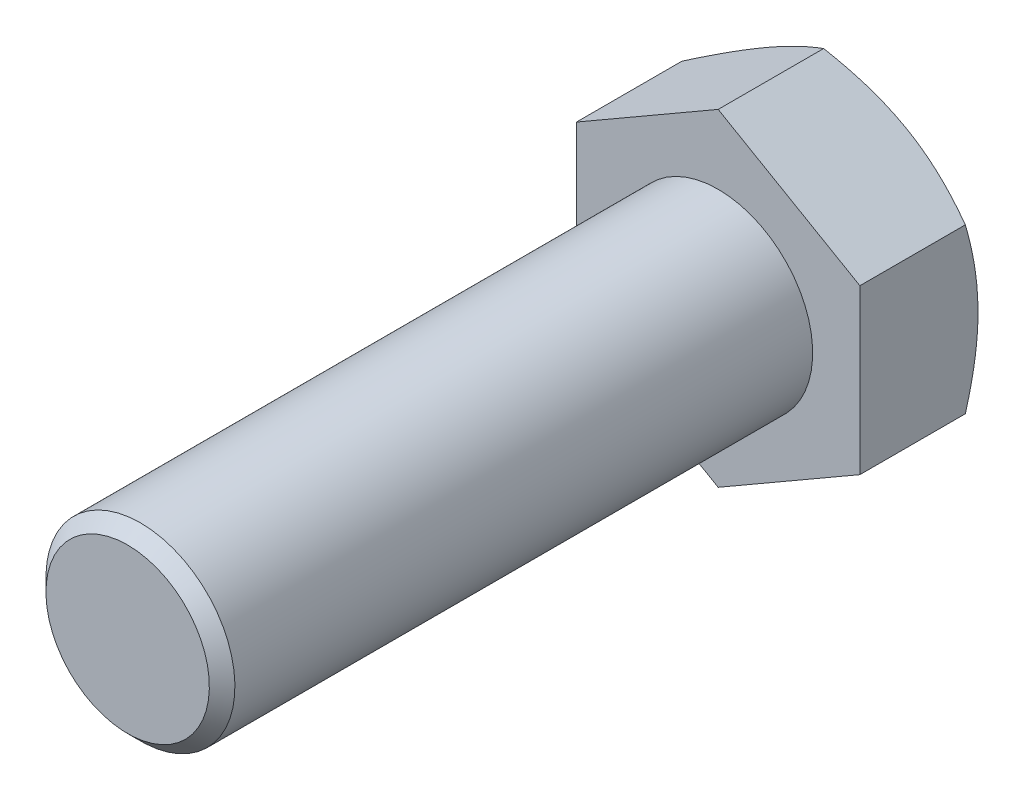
ISO-10303-21;
HEADER;
FILE_DESCRIPTION(('STEP AP214'),'2;1');
FILE_NAME('part.step','',(''),(''),'','','');
FILE_SCHEMA(('AUTOMOTIVE_DESIGN { 1 0 10303 214 1 1 1 1 }'));
ENDSEC;
DATA;
#1=APPLICATION_CONTEXT('core data for automotive mechanical design processes');
#2=APPLICATION_PROTOCOL_DEFINITION('international standard','automotive_design',2000,#1);
#3=PRODUCT_CONTEXT('',#1,'mechanical');
#4=PRODUCT('Part','Part','',(#3));
#5=PRODUCT_RELATED_PRODUCT_CATEGORY('part','',(#4));
#6=PRODUCT_DEFINITION_FORMATION('','',#4);
#7=PRODUCT_DEFINITION_CONTEXT('part definition',#1,'design');
#8=PRODUCT_DEFINITION('design','',#6,#7);
#9=PRODUCT_DEFINITION_SHAPE('','',#8);
#10=(LENGTH_UNIT() NAMED_UNIT(*) SI_UNIT(.MILLI.,.METRE.));
#11=(NAMED_UNIT(*) PLANE_ANGLE_UNIT() SI_UNIT($,.RADIAN.));
#12=(NAMED_UNIT(*) SI_UNIT($,.STERADIAN.) SOLID_ANGLE_UNIT());
#13=UNCERTAINTY_MEASURE_WITH_UNIT(LENGTH_MEASURE(1.E-05),#10,'distance_accuracy_value','');
#14=(GEOMETRIC_REPRESENTATION_CONTEXT(3) GLOBAL_UNCERTAINTY_ASSIGNED_CONTEXT((#13)) GLOBAL_UNIT_ASSIGNED_CONTEXT((#10,
#11,#12)) REPRESENTATION_CONTEXT('',''));
#15=CARTESIAN_POINT('',(0.,0.,0.));
#16=DIRECTION('',(0.,0.,1.));
#17=DIRECTION('',(1.,0.,0.));
#18=AXIS2_PLACEMENT_3D('',#15,#16,#17);
#19=CARTESIAN_POINT('',(0.,0.,0.));
#20=DIRECTION('',(0.,0.,-1.));
#21=DIRECTION('',(-1.,0.,0.));
#22=AXIS2_PLACEMENT_3D('',#19,#20,#21);
#23=PLANE('',#22);
#24=DIRECTION('',(0.866025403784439,-0.5,0.));
#25=VECTOR('',#24,1.);
#26=CARTESIAN_POINT('',(0.,13.856406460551,0.));
#27=LINE('',#26,#25);
#28=CARTESIAN_POINT('',(0.,13.856406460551,0.));
#29=VERTEX_POINT('',#28);
#30=CARTESIAN_POINT('',(12.,6.92820323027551,0.));
#31=VERTEX_POINT('',#30);
#32=EDGE_CURVE('E11',#29,#31,#27,.T.);
#33=ORIENTED_EDGE('',*,*,#32,.F.);
#34=DIRECTION('',(0.866025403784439,0.5,0.));
#35=VECTOR('',#34,1.);
#36=CARTESIAN_POINT('',(-12.,6.92820323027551,0.));
#37=LINE('',#36,#35);
#38=CARTESIAN_POINT('',(-12.,6.92820323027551,0.));
#39=VERTEX_POINT('',#38);
#40=EDGE_CURVE('E133',#39,#29,#37,.T.);
#41=ORIENTED_EDGE('',*,*,#40,.F.);
#42=DIRECTION('',(0.,1.,0.));
#43=VECTOR('',#42,1.);
#44=CARTESIAN_POINT('',(-12.,-6.92820323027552,0.));
#45=LINE('',#44,#43);
#46=CARTESIAN_POINT('',(-12.,-6.92820323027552,0.));
#47=VERTEX_POINT('',#46);
#48=EDGE_CURVE('E28',#47,#39,#45,.T.);
#49=ORIENTED_EDGE('',*,*,#48,.F.);
#50=DIRECTION('',(-0.866025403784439,0.5,0.));
#51=VECTOR('',#50,1.);
#52=CARTESIAN_POINT('',(0.,-13.856406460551,0.));
#53=LINE('',#52,#51);
#54=CARTESIAN_POINT('',(0.,-13.856406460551,0.));
#55=VERTEX_POINT('',#54);
#56=EDGE_CURVE('E104',#55,#47,#53,.T.);
#57=ORIENTED_EDGE('',*,*,#56,.F.);
#58=DIRECTION('',(-0.866025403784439,-0.5,0.));
#59=VECTOR('',#58,1.);
#60=CARTESIAN_POINT('',(12.,-6.92820323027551,0.));
#61=LINE('',#60,#59);
#62=CARTESIAN_POINT('',(12.,-6.92820323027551,0.));
#63=VERTEX_POINT('',#62);
#64=EDGE_CURVE('E99',#63,#55,#61,.T.);
#65=ORIENTED_EDGE('',*,*,#64,.F.);
#66=DIRECTION('',(0.,-1.,0.));
#67=VECTOR('',#66,1.);
#68=CARTESIAN_POINT('',(12.,6.92820323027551,0.));
#69=LINE('',#68,#67);
#70=EDGE_CURVE('E154',#31,#63,#69,.T.);
#71=ORIENTED_EDGE('',*,*,#70,.F.);
#72=EDGE_LOOP('',(#33,#41,#49,#57,#65,#71));
#73=FACE_BOUND('',#72,.T.);
#74=CARTESIAN_POINT('',(0.,0.,0.));
#75=DIRECTION('',(0.,0.,-1.));
#76=DIRECTION('',(0.,1.,0.));
#77=AXIS2_PLACEMENT_3D('',#74,#75,#76);
#78=CIRCLE('',#77,8.);
#79=CARTESIAN_POINT('',(0.,-8.,0.));
#80=VERTEX_POINT('',#79);
#81=EDGE_CURVE('E175',#80,#80,#78,.T.);
#82=ORIENTED_EDGE('',*,*,#81,.T.);
#83=EDGE_LOOP('',(#82));
#84=FACE_BOUND('',#83,.T.);
#85=ADVANCED_FACE('F16',(#73,#84),#23,.F.);
#86=CARTESIAN_POINT('',(0.,0.,-10.));
#87=DIRECTION('',(0.,0.,-1.));
#88=DIRECTION('',(-1.,0.,0.));
#89=AXIS2_PLACEMENT_3D('',#86,#87,#88);
#90=PLANE('',#89);
#91=CARTESIAN_POINT('',(0.,0.,-10.));
#92=DIRECTION('',(0.,0.,1.));
#93=DIRECTION('',(0.,1.,0.));
#94=AXIS2_PLACEMENT_3D('',#91,#92,#93);
#95=CIRCLE('',#94,12.);
#96=CARTESIAN_POINT('',(6.,-10.3923048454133,-10.));
#97=VERTEX_POINT('',#96);
#98=CARTESIAN_POINT('',(12.,0.,-10.));
#99=VERTEX_POINT('',#98);
#100=EDGE_CURVE('E124',#97,#99,#95,.T.);
#101=ORIENTED_EDGE('',*,*,#100,.F.);
#102=CARTESIAN_POINT('',(0.,0.,-10.));
#103=DIRECTION('',(0.,0.,1.));
#104=DIRECTION('',(0.,1.,0.));
#105=AXIS2_PLACEMENT_3D('',#102,#103,#104);
#106=CIRCLE('',#105,12.);
#107=CARTESIAN_POINT('',(-6.,-10.3923048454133,-10.));
#108=VERTEX_POINT('',#107);
#109=EDGE_CURVE('E112',#108,#97,#106,.T.);
#110=ORIENTED_EDGE('',*,*,#109,.F.);
#111=CARTESIAN_POINT('',(0.,0.,-10.));
#112=DIRECTION('',(0.,0.,1.));
#113=DIRECTION('',(0.,1.,0.));
#114=AXIS2_PLACEMENT_3D('',#111,#112,#113);
#115=CIRCLE('',#114,12.);
#116=CARTESIAN_POINT('',(-12.,0.,-10.));
#117=VERTEX_POINT('',#116);
#118=EDGE_CURVE('E165',#117,#108,#115,.T.);
#119=ORIENTED_EDGE('',*,*,#118,.F.);
#120=CARTESIAN_POINT('',(0.,0.,-10.));
#121=DIRECTION('',(0.,0.,1.));
#122=DIRECTION('',(0.,1.,0.));
#123=AXIS2_PLACEMENT_3D('',#120,#121,#122);
#124=CIRCLE('',#123,12.);
#125=CARTESIAN_POINT('',(-6.,10.3923048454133,-10.));
#126=VERTEX_POINT('',#125);
#127=EDGE_CURVE('E149',#126,#117,#124,.T.);
#128=ORIENTED_EDGE('',*,*,#127,.F.);
#129=CARTESIAN_POINT('',(0.,0.,-10.));
#130=DIRECTION('',(0.,0.,1.));
#131=DIRECTION('',(0.,1.,0.));
#132=AXIS2_PLACEMENT_3D('',#129,#130,#131);
#133=CIRCLE('',#132,12.);
#134=CARTESIAN_POINT('',(6.,10.3923048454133,-10.));
#135=VERTEX_POINT('',#134);
#136=EDGE_CURVE('E211',#135,#126,#133,.T.);
#137=ORIENTED_EDGE('',*,*,#136,.F.);
#138=CARTESIAN_POINT('',(0.,0.,-10.));
#139=DIRECTION('',(0.,0.,1.));
#140=DIRECTION('',(0.,1.,0.));
#141=AXIS2_PLACEMENT_3D('',#138,#139,#140);
#142=CIRCLE('',#141,12.);
#143=EDGE_CURVE('E105',#99,#135,#142,.T.);
#144=ORIENTED_EDGE('',*,*,#143,.F.);
#145=EDGE_LOOP('',(#101,#110,#119,#128,#137,#144));
#146=FACE_BOUND('',#145,.T.);
#147=ADVANCED_FACE('F261',(#146),#90,.T.);
#148=CARTESIAN_POINT('',(6.,10.3923048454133,0.));
#149=DIRECTION('',(0.5,0.866025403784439,0.));
#150=DIRECTION('',(0.866025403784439,-0.5,0.));
#151=AXIS2_PLACEMENT_3D('',#148,#149,#150);
#152=PLANE('',#151);
#153=CARTESIAN_POINT('',(-0.00622177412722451,13.8599986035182,-8.9261284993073));
#154=CARTESIAN_POINT('',(3.21289012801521,12.0014434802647,-10.));
#155=CARTESIAN_POINT('',(6.,10.3923048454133,-10.));
#156=CARTESIAN_POINT('',(8.78710987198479,8.78316621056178,-10.));
#157=CARTESIAN_POINT('',(12.0062217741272,6.92461108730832,-8.9261284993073));
#158=(BOUNDED_CURVE() B_SPLINE_CURVE(2,(#153,#154,#155,#156,#157),.UNSPECIFIED.,.F.,
.F.) B_SPLINE_CURVE_WITH_KNOTS((3,2,3),(0.,7.03597967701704,14.0719593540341),
.UNSPECIFIED.) CURVE() GEOMETRIC_REPRESENTATION_ITEM() RATIONAL_B_SPLINE_CURVE((1.,
1.03802697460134,1.,1.03802697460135,1.)) REPRESENTATION_ITEM(''));
#159=CARTESIAN_POINT('',(0.,13.856406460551,-8.92820323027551));
#160=VERTEX_POINT('',#159);
#161=EDGE_CURVE('E186',#160,#135,#158,.T.);
#162=ORIENTED_EDGE('',*,*,#161,.F.);
#163=DIRECTION('',(0.,0.,-1.));
#164=VECTOR('',#163,1.);
#165=CARTESIAN_POINT('',(0.,13.856406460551,0.));
#166=LINE('',#165,#164);
#167=EDGE_CURVE('E139',#29,#160,#166,.T.);
#168=ORIENTED_EDGE('',*,*,#167,.F.);
#169=ORIENTED_EDGE('',*,*,#32,.T.);
#170=DIRECTION('',(0.,0.,-1.));
#171=VECTOR('',#170,1.);
#172=CARTESIAN_POINT('',(12.,6.92820323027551,0.));
#173=LINE('',#172,#171);
#174=CARTESIAN_POINT('',(12.,6.92820323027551,-8.92820323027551));
#175=VERTEX_POINT('',#174);
#176=EDGE_CURVE('E142',#31,#175,#173,.T.);
#177=ORIENTED_EDGE('',*,*,#176,.T.);
#178=CARTESIAN_POINT('',(-0.00622177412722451,13.8599986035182,-8.9261284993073));
#179=CARTESIAN_POINT('',(3.21289012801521,12.0014434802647,-10.));
#180=CARTESIAN_POINT('',(6.,10.3923048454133,-10.));
#181=CARTESIAN_POINT('',(8.78710987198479,8.78316621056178,-10.));
#182=CARTESIAN_POINT('',(12.0062217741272,6.92461108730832,-8.9261284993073));
#183=(BOUNDED_CURVE() B_SPLINE_CURVE(2,(#178,#179,#180,#181,#182),.UNSPECIFIED.,.F.,
.F.) B_SPLINE_CURVE_WITH_KNOTS((3,2,3),(0.,7.03597967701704,14.0719593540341),
.UNSPECIFIED.) CURVE() GEOMETRIC_REPRESENTATION_ITEM() RATIONAL_B_SPLINE_CURVE((1.,
1.03802697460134,1.,1.03802697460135,1.)) REPRESENTATION_ITEM(''));
#184=EDGE_CURVE('E20',#135,#175,#183,.T.);
#185=ORIENTED_EDGE('',*,*,#184,.F.);
#186=EDGE_LOOP('',(#162,#168,#169,#177,#185));
#187=FACE_BOUND('',#186,.T.);
#188=ADVANCED_FACE('F266',(#187),#152,.T.);
#189=CARTESIAN_POINT('',(-12.,0.,0.));
#190=DIRECTION('',(-1.,0.,0.));
#191=DIRECTION('',(0.,1.,0.));
#192=AXIS2_PLACEMENT_3D('',#189,#190,#191);
#193=PLANE('',#192);
#194=CARTESIAN_POINT('',(-12.,-6.9353875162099,-8.9261284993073));
#195=CARTESIAN_POINT('',(-12.,-3.21827726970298,-10.));
#196=CARTESIAN_POINT('',(-12.,0.,-10.));
#197=CARTESIAN_POINT('',(-12.,3.21827726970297,-10.));
#198=CARTESIAN_POINT('',(-12.,6.9353875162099,-8.9261284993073));
#199=(BOUNDED_CURVE() B_SPLINE_CURVE(2,(#194,#195,#196,#197,#198),.UNSPECIFIED.,.F.,
.F.) B_SPLINE_CURVE_WITH_KNOTS((3,2,3),(0.,7.03597967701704,14.0719593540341),
.UNSPECIFIED.) CURVE() GEOMETRIC_REPRESENTATION_ITEM() RATIONAL_B_SPLINE_CURVE((1.,
1.03802697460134,1.,1.03802697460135,1.)) REPRESENTATION_ITEM(''));
#200=CARTESIAN_POINT('',(-12.,-6.92820323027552,-8.92820323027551));
#201=VERTEX_POINT('',#200);
#202=EDGE_CURVE('E114',#201,#117,#199,.T.);
#203=ORIENTED_EDGE('',*,*,#202,.F.);
#204=DIRECTION('',(0.,0.,-1.));
#205=VECTOR('',#204,1.);
#206=CARTESIAN_POINT('',(-12.,-6.92820323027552,0.));
#207=LINE('',#206,#205);
#208=EDGE_CURVE('E192',#47,#201,#207,.T.);
#209=ORIENTED_EDGE('',*,*,#208,.F.);
#210=ORIENTED_EDGE('',*,*,#48,.T.);
#211=DIRECTION('',(0.,0.,-1.));
#212=VECTOR('',#211,1.);
#213=CARTESIAN_POINT('',(-12.,6.92820323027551,0.));
#214=LINE('',#213,#212);
#215=CARTESIAN_POINT('',(-12.,6.92820323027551,-8.92820323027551));
#216=VERTEX_POINT('',#215);
#217=EDGE_CURVE('E140',#39,#216,#214,.T.);
#218=ORIENTED_EDGE('',*,*,#217,.T.);
#219=CARTESIAN_POINT('',(-12.,-6.9353875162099,-8.9261284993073));
#220=CARTESIAN_POINT('',(-12.,-3.21827726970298,-10.));
#221=CARTESIAN_POINT('',(-12.,0.,-10.));
#222=CARTESIAN_POINT('',(-12.,3.21827726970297,-10.));
#223=CARTESIAN_POINT('',(-12.,6.9353875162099,-8.9261284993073));
#224=(BOUNDED_CURVE() B_SPLINE_CURVE(2,(#219,#220,#221,#222,#223),.UNSPECIFIED.,.F.,
.F.) B_SPLINE_CURVE_WITH_KNOTS((3,2,3),(0.,7.03597967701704,14.0719593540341),
.UNSPECIFIED.) CURVE() GEOMETRIC_REPRESENTATION_ITEM() RATIONAL_B_SPLINE_CURVE((1.,
1.03802697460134,1.,1.03802697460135,1.)) REPRESENTATION_ITEM(''));
#225=EDGE_CURVE('E150',#117,#216,#224,.T.);
#226=ORIENTED_EDGE('',*,*,#225,.F.);
#227=EDGE_LOOP('',(#203,#209,#210,#218,#226));
#228=FACE_BOUND('',#227,.T.);
#229=ADVANCED_FACE('F280',(#228),#193,.T.);
#230=CARTESIAN_POINT('',(-6.,10.3923048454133,0.));
#231=DIRECTION('',(-0.5,0.866025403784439,0.));
#232=DIRECTION('',(0.866025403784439,0.5,0.));
#233=AXIS2_PLACEMENT_3D('',#230,#231,#232);
#234=PLANE('',#233);
#235=CARTESIAN_POINT('',(-12.0062217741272,6.92461108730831,-8.9261284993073));
#236=CARTESIAN_POINT('',(-8.7871098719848,8.78316621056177,-10.));
#237=CARTESIAN_POINT('',(-6.,10.3923048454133,-10.));
#238=CARTESIAN_POINT('',(-3.21289012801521,12.0014434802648,-10.));
#239=CARTESIAN_POINT('',(0.00622177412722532,13.8599986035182,-8.9261284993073));
#240=(BOUNDED_CURVE() B_SPLINE_CURVE(2,(#235,#236,#237,#238,#239),.UNSPECIFIED.,.F.,
.F.) B_SPLINE_CURVE_WITH_KNOTS((3,2,3),(0.,7.03597967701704,14.0719593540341),
.UNSPECIFIED.) CURVE() GEOMETRIC_REPRESENTATION_ITEM() RATIONAL_B_SPLINE_CURVE((1.,
1.03802697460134,1.,1.03802697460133,1.)) REPRESENTATION_ITEM(''));
#241=EDGE_CURVE('E144',#216,#126,#240,.T.);
#242=ORIENTED_EDGE('',*,*,#241,.F.);
#243=ORIENTED_EDGE('',*,*,#217,.F.);
#244=ORIENTED_EDGE('',*,*,#40,.T.);
#245=ORIENTED_EDGE('',*,*,#167,.T.);
#246=CARTESIAN_POINT('',(-12.0062217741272,6.92461108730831,-8.9261284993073));
#247=CARTESIAN_POINT('',(-8.7871098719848,8.78316621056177,-10.));
#248=CARTESIAN_POINT('',(-6.,10.3923048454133,-10.));
#249=CARTESIAN_POINT('',(-3.21289012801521,12.0014434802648,-10.));
#250=CARTESIAN_POINT('',(0.00622177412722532,13.8599986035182,-8.9261284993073));
#251=(BOUNDED_CURVE() B_SPLINE_CURVE(2,(#246,#247,#248,#249,#250),.UNSPECIFIED.,.F.,
.F.) B_SPLINE_CURVE_WITH_KNOTS((3,2,3),(0.,7.03597967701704,14.0719593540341),
.UNSPECIFIED.) CURVE() GEOMETRIC_REPRESENTATION_ITEM() RATIONAL_B_SPLINE_CURVE((1.,
1.03802697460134,1.,1.03802697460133,1.)) REPRESENTATION_ITEM(''));
#252=EDGE_CURVE('E174',#126,#160,#251,.T.);
#253=ORIENTED_EDGE('',*,*,#252,.F.);
#254=EDGE_LOOP('',(#242,#243,#244,#245,#253));
#255=FACE_BOUND('',#254,.T.);
#256=ADVANCED_FACE('F275',(#255),#234,.T.);
#257=CARTESIAN_POINT('',(12.,0.,0.));
#258=DIRECTION('',(1.,0.,0.));
#259=DIRECTION('',(0.,-1.,0.));
#260=AXIS2_PLACEMENT_3D('',#257,#258,#259);
#261=PLANE('',#260);
#262=CARTESIAN_POINT('',(12.,6.9353875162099,-8.9261284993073));
#263=CARTESIAN_POINT('',(12.,3.21827726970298,-10.));
#264=CARTESIAN_POINT('',(12.,0.,-10.));
#265=CARTESIAN_POINT('',(12.,-3.21827726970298,-10.));
#266=CARTESIAN_POINT('',(12.,-6.93538751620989,-8.9261284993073));
#267=(BOUNDED_CURVE() B_SPLINE_CURVE(2,(#262,#263,#264,#265,#266),.UNSPECIFIED.,.F.,
.F.) B_SPLINE_CURVE_WITH_KNOTS((3,2,3),(0.,7.03597967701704,14.0719593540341),
.UNSPECIFIED.) CURVE() GEOMETRIC_REPRESENTATION_ITEM() RATIONAL_B_SPLINE_CURVE((1.,
1.03802697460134,1.,1.03802697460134,1.)) REPRESENTATION_ITEM(''));
#268=CARTESIAN_POINT('',(12.,-6.9282032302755,-8.92820323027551));
#269=VERTEX_POINT('',#268);
#270=EDGE_CURVE('E120',#99,#269,#267,.T.);
#271=ORIENTED_EDGE('',*,*,#270,.F.);
#272=CARTESIAN_POINT('',(12.,6.9353875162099,-8.9261284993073));
#273=CARTESIAN_POINT('',(12.,3.21827726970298,-10.));
#274=CARTESIAN_POINT('',(12.,0.,-10.));
#275=CARTESIAN_POINT('',(12.,-3.21827726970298,-10.));
#276=CARTESIAN_POINT('',(12.,-6.93538751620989,-8.9261284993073));
#277=(BOUNDED_CURVE() B_SPLINE_CURVE(2,(#272,#273,#274,#275,#276),.UNSPECIFIED.,.F.,
.F.) B_SPLINE_CURVE_WITH_KNOTS((3,2,3),(0.,7.03597967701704,14.0719593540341),
.UNSPECIFIED.) CURVE() GEOMETRIC_REPRESENTATION_ITEM() RATIONAL_B_SPLINE_CURVE((1.,
1.03802697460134,1.,1.03802697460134,1.)) REPRESENTATION_ITEM(''));
#278=EDGE_CURVE('E180',#175,#99,#277,.T.);
#279=ORIENTED_EDGE('',*,*,#278,.F.);
#280=ORIENTED_EDGE('',*,*,#176,.F.);
#281=ORIENTED_EDGE('',*,*,#70,.T.);
#282=DIRECTION('',(0.,0.,-1.));
#283=VECTOR('',#282,1.);
#284=CARTESIAN_POINT('',(12.,-6.92820323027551,0.));
#285=LINE('',#284,#283);
#286=EDGE_CURVE('E143',#63,#269,#285,.T.);
#287=ORIENTED_EDGE('',*,*,#286,.T.);
#288=EDGE_LOOP('',(#271,#279,#280,#281,#287));
#289=FACE_BOUND('',#288,.T.);
#290=ADVANCED_FACE('F272',(#289),#261,.T.);
#291=CARTESIAN_POINT('',(6.,-10.3923048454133,0.));
#292=DIRECTION('',(0.5,-0.866025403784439,0.));
#293=DIRECTION('',(-0.866025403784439,-0.5,0.));
#294=AXIS2_PLACEMENT_3D('',#291,#292,#293);
#295=PLANE('',#294);
#296=CARTESIAN_POINT('',(12.0062217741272,-6.92461108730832,-8.9261284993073));
#297=CARTESIAN_POINT('',(8.78710987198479,-8.78316621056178,-10.));
#298=CARTESIAN_POINT('',(6.,-10.3923048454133,-10.));
#299=CARTESIAN_POINT('',(3.21289012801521,-12.0014434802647,-10.));
#300=CARTESIAN_POINT('',(-0.00622177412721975,-13.8599986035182,-8.9261284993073));
#301=(BOUNDED_CURVE() B_SPLINE_CURVE(2,(#296,#297,#298,#299,#300),.UNSPECIFIED.,.F.,
.F.) B_SPLINE_CURVE_WITH_KNOTS((3,2,3),(0.,7.03597967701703,14.0719593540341),
.UNSPECIFIED.) CURVE() GEOMETRIC_REPRESENTATION_ITEM() RATIONAL_B_SPLINE_CURVE((1.,
1.03802697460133,1.,1.03802697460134,1.)) REPRESENTATION_ITEM(''));
#302=CARTESIAN_POINT('',(0.,-13.856406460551,-8.92820323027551));
#303=VERTEX_POINT('',#302);
#304=EDGE_CURVE('E95',#97,#303,#301,.T.);
#305=ORIENTED_EDGE('',*,*,#304,.F.);
#306=CARTESIAN_POINT('',(12.0062217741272,-6.92461108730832,-8.9261284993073));
#307=CARTESIAN_POINT('',(8.78710987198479,-8.78316621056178,-10.));
#308=CARTESIAN_POINT('',(6.,-10.3923048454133,-10.));
#309=CARTESIAN_POINT('',(3.21289012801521,-12.0014434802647,-10.));
#310=CARTESIAN_POINT('',(-0.00622177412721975,-13.8599986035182,-8.9261284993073));
#311=(BOUNDED_CURVE() B_SPLINE_CURVE(2,(#306,#307,#308,#309,#310),.UNSPECIFIED.,.F.,
.F.) B_SPLINE_CURVE_WITH_KNOTS((3,2,3),(0.,7.03597967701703,14.0719593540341),
.UNSPECIFIED.) CURVE() GEOMETRIC_REPRESENTATION_ITEM() RATIONAL_B_SPLINE_CURVE((1.,
1.03802697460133,1.,1.03802697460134,1.)) REPRESENTATION_ITEM(''));
#312=EDGE_CURVE('E172',#269,#97,#311,.T.);
#313=ORIENTED_EDGE('',*,*,#312,.F.);
#314=ORIENTED_EDGE('',*,*,#286,.F.);
#315=ORIENTED_EDGE('',*,*,#64,.T.);
#316=DIRECTION('',(0.,0.,-1.));
#317=VECTOR('',#316,1.);
#318=CARTESIAN_POINT('',(0.,-13.856406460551,0.));
#319=LINE('',#318,#317);
#320=EDGE_CURVE('E91',#55,#303,#319,.T.);
#321=ORIENTED_EDGE('',*,*,#320,.T.);
#322=EDGE_LOOP('',(#305,#313,#314,#315,#321));
#323=FACE_BOUND('',#322,.T.);
#324=ADVANCED_FACE('F93',(#323),#295,.T.);
#325=CARTESIAN_POINT('',(-6.,-10.3923048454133,0.));
#326=DIRECTION('',(-0.5,-0.866025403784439,0.));
#327=DIRECTION('',(-0.866025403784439,0.5,0.));
#328=AXIS2_PLACEMENT_3D('',#325,#326,#327);
#329=PLANE('',#328);
#330=CARTESIAN_POINT('',(0.00622177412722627,-13.8599986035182,-8.9261284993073));
#331=CARTESIAN_POINT('',(-3.21289012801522,-12.0014434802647,-10.));
#332=CARTESIAN_POINT('',(-6.,-10.3923048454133,-10.));
#333=CARTESIAN_POINT('',(-8.78710987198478,-8.7831662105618,-10.));
#334=CARTESIAN_POINT('',(-12.0062217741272,-6.92461108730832,-8.9261284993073));
#335=(BOUNDED_CURVE() B_SPLINE_CURVE(2,(#330,#331,#332,#333,#334),.UNSPECIFIED.,.F.,
.F.) B_SPLINE_CURVE_WITH_KNOTS((3,2,3),(0.,7.03597967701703,14.0719593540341),
.UNSPECIFIED.) CURVE() GEOMETRIC_REPRESENTATION_ITEM() RATIONAL_B_SPLINE_CURVE((1.,
1.03802697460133,1.,1.03802697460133,1.)) REPRESENTATION_ITEM(''));
#336=EDGE_CURVE('E118',#108,#201,#335,.T.);
#337=ORIENTED_EDGE('',*,*,#336,.F.);
#338=CARTESIAN_POINT('',(0.00622177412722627,-13.8599986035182,-8.9261284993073));
#339=CARTESIAN_POINT('',(-3.21289012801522,-12.0014434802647,-10.));
#340=CARTESIAN_POINT('',(-6.,-10.3923048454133,-10.));
#341=CARTESIAN_POINT('',(-8.78710987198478,-8.7831662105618,-10.));
#342=CARTESIAN_POINT('',(-12.0062217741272,-6.92461108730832,-8.9261284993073));
#343=(BOUNDED_CURVE() B_SPLINE_CURVE(2,(#338,#339,#340,#341,#342),.UNSPECIFIED.,.F.,
.F.) B_SPLINE_CURVE_WITH_KNOTS((3,2,3),(0.,7.03597967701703,14.0719593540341),
.UNSPECIFIED.) CURVE() GEOMETRIC_REPRESENTATION_ITEM() RATIONAL_B_SPLINE_CURVE((1.,
1.03802697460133,1.,1.03802697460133,1.)) REPRESENTATION_ITEM(''));
#344=EDGE_CURVE('E110',#303,#108,#343,.T.);
#345=ORIENTED_EDGE('',*,*,#344,.F.);
#346=ORIENTED_EDGE('',*,*,#320,.F.);
#347=ORIENTED_EDGE('',*,*,#56,.T.);
#348=ORIENTED_EDGE('',*,*,#208,.T.);
#349=EDGE_LOOP('',(#337,#345,#346,#347,#348));
#350=FACE_BOUND('',#349,.T.);
#351=ADVANCED_FACE('F116',(#350),#329,.T.);
#352=CARTESIAN_POINT('',(0.,0.,-9.46306424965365));
#353=DIRECTION('',(0.,0.,1.));
#354=DIRECTION('',(0.,1.,0.));
#355=AXIS2_PLACEMENT_3D('',#352,#353,#354);
#356=CONICAL_SURFACE('',#355,12.93,1.0471975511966);
#357=ORIENTED_EDGE('',*,*,#184,.T.);
#358=ORIENTED_EDGE('',*,*,#278,.T.);
#359=ORIENTED_EDGE('',*,*,#143,.T.);
#360=EDGE_LOOP('',(#357,#358,#359));
#361=FACE_BOUND('',#360,.T.);
#362=ADVANCED_FACE('F278',(#361),#356,.T.);
#363=CARTESIAN_POINT('',(0.,0.,-9.46306424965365));
#364=DIRECTION('',(0.,0.,1.));
#365=DIRECTION('',(0.,1.,0.));
#366=AXIS2_PLACEMENT_3D('',#363,#364,#365);
#367=CONICAL_SURFACE('',#366,12.93,1.0471975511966);
#368=ORIENTED_EDGE('',*,*,#252,.T.);
#369=ORIENTED_EDGE('',*,*,#161,.T.);
#370=ORIENTED_EDGE('',*,*,#136,.T.);
#371=EDGE_LOOP('',(#368,#369,#370));
#372=FACE_BOUND('',#371,.T.);
#373=ADVANCED_FACE('F303',(#372),#367,.T.);
#374=CARTESIAN_POINT('',(0.,0.,-9.46306424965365));
#375=DIRECTION('',(0.,0.,1.));
#376=DIRECTION('',(0.,1.,0.));
#377=AXIS2_PLACEMENT_3D('',#374,#375,#376);
#378=CONICAL_SURFACE('',#377,12.93,1.0471975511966);
#379=ORIENTED_EDGE('',*,*,#225,.T.);
#380=ORIENTED_EDGE('',*,*,#241,.T.);
#381=ORIENTED_EDGE('',*,*,#127,.T.);
#382=EDGE_LOOP('',(#379,#380,#381));
#383=FACE_BOUND('',#382,.T.);
#384=ADVANCED_FACE('F310',(#383),#378,.T.);
#385=CARTESIAN_POINT('',(0.,0.,-9.46306424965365));
#386=DIRECTION('',(0.,0.,1.));
#387=DIRECTION('',(0.,1.,0.));
#388=AXIS2_PLACEMENT_3D('',#385,#386,#387);
#389=CONICAL_SURFACE('',#388,12.93,1.0471975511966);
#390=ORIENTED_EDGE('',*,*,#202,.T.);
#391=ORIENTED_EDGE('',*,*,#118,.T.);
#392=ORIENTED_EDGE('',*,*,#336,.T.);
#393=EDGE_LOOP('',(#390,#391,#392));
#394=FACE_BOUND('',#393,.T.);
#395=ADVANCED_FACE('F18',(#394),#389,.T.);
#396=CARTESIAN_POINT('',(0.,0.,-9.46306424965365));
#397=DIRECTION('',(0.,0.,1.));
#398=DIRECTION('',(0.,1.,0.));
#399=AXIS2_PLACEMENT_3D('',#396,#397,#398);
#400=CONICAL_SURFACE('',#399,12.93,1.0471975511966);
#401=ORIENTED_EDGE('',*,*,#344,.T.);
#402=ORIENTED_EDGE('',*,*,#109,.T.);
#403=ORIENTED_EDGE('',*,*,#304,.T.);
#404=EDGE_LOOP('',(#401,#402,#403));
#405=FACE_BOUND('',#404,.T.);
#406=ADVANCED_FACE('F109',(#405),#400,.T.);
#407=CARTESIAN_POINT('',(0.,0.,-9.46306424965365));
#408=DIRECTION('',(0.,0.,1.));
#409=DIRECTION('',(0.,1.,0.));
#410=AXIS2_PLACEMENT_3D('',#407,#408,#409);
#411=CONICAL_SURFACE('',#410,12.93,1.0471975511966);
#412=ORIENTED_EDGE('',*,*,#312,.T.);
#413=ORIENTED_EDGE('',*,*,#100,.T.);
#414=ORIENTED_EDGE('',*,*,#270,.T.);
#415=EDGE_LOOP('',(#412,#413,#414));
#416=FACE_BOUND('',#415,.T.);
#417=ADVANCED_FACE('F283',(#416),#411,.T.);
#418=CARTESIAN_POINT('',(0.,3.45875,50.));
#419=DIRECTION('',(0.,0.,1.));
#420=DIRECTION('',(0.,1.,0.));
#421=AXIS2_PLACEMENT_3D('',#418,#419,#420);
#422=PLANE('',#421);
#423=CARTESIAN_POINT('',(0.,0.,50.));
#424=DIRECTION('',(0.,0.,1.));
#425=DIRECTION('',(0.,1.,0.));
#426=AXIS2_PLACEMENT_3D('',#423,#424,#425);
#427=CIRCLE('',#426,6.9175);
#428=CARTESIAN_POINT('',(0.,6.9175,50.));
#429=VERTEX_POINT('',#428);
#430=EDGE_CURVE('E178',#429,#429,#427,.T.);
#431=ORIENTED_EDGE('',*,*,#430,.T.);
#432=EDGE_LOOP('',(#431));
#433=FACE_BOUND('',#432,.T.);
#434=ADVANCED_FACE('F255',(#433),#422,.T.);
#435=CARTESIAN_POINT('',(0.,0.,49.45875));
#436=DIRECTION('',(0.,0.,-1.));
#437=DIRECTION('',(0.,1.,0.));
#438=AXIS2_PLACEMENT_3D('',#435,#436,#437);
#439=CONICAL_SURFACE('',#438,7.45875,0.78539816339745);
#440=CARTESIAN_POINT('',(0.,0.,48.9175));
#441=DIRECTION('',(0.,0.,1.));
#442=DIRECTION('',(0.,1.,0.));
#443=AXIS2_PLACEMENT_3D('',#440,#441,#442);
#444=CIRCLE('',#443,8.);
#445=CARTESIAN_POINT('',(0.,8.,48.9175));
#446=VERTEX_POINT('',#445);
#447=EDGE_CURVE('E179',#446,#446,#444,.T.);
#448=ORIENTED_EDGE('',*,*,#447,.T.);
#449=EDGE_LOOP('',(#448));
#450=FACE_BOUND('',#449,.T.);
#451=ORIENTED_EDGE('',*,*,#430,.F.);
#452=EDGE_LOOP('',(#451));
#453=FACE_BOUND('',#452,.T.);
#454=ADVANCED_FACE('F244',(#450,#453),#439,.T.);
#455=CARTESIAN_POINT('',(0.,0.,23.45875));
#456=DIRECTION('',(0.,0.,-1.));
#457=DIRECTION('',(0.,1.,0.));
#458=AXIS2_PLACEMENT_3D('',#455,#456,#457);
#459=CYLINDRICAL_SURFACE('',#458,8.);
#460=ORIENTED_EDGE('',*,*,#81,.F.);
#461=EDGE_LOOP('',(#460));
#462=FACE_BOUND('',#461,.T.);
#463=ORIENTED_EDGE('',*,*,#447,.F.);
#464=EDGE_LOOP('',(#463));
#465=FACE_BOUND('',#464,.T.);
#466=ADVANCED_FACE('F247',(#462,#465),#459,.T.);
#467=CLOSED_SHELL('',(#85,#147,#188,#229,#256,#290,#324,#351,#362,#373,#384,#395,#406,#417,#434,
#454,#466));
#468=MANIFOLD_SOLID_BREP('B1',#467);
#469=ADVANCED_BREP_SHAPE_REPRESENTATION('',(#18,#468),#14);
#470=SHAPE_DEFINITION_REPRESENTATION(#9,#469);
ENDSEC;
END-ISO-10303-21;
